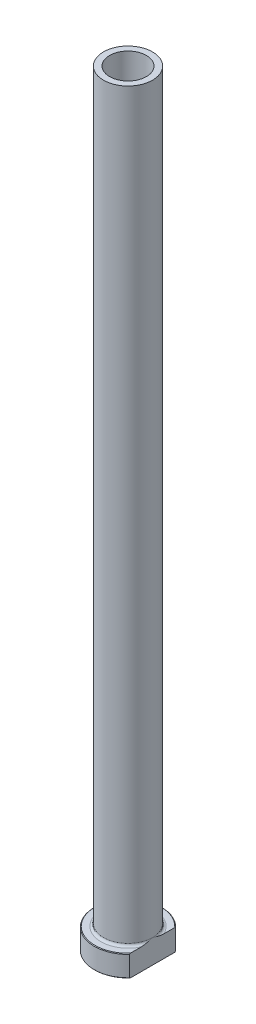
from build123d import *

# Parameters (mm, degrees)
FILLET1_R          = 0.8
CHAMFER1_SIZE      = 0.2
CUT_EXTRUDE1_DEPTH = 251.483532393
CHAMFER2_SIZE      = 0.5


with BuildPart() as part:
    # Sketch1 → Revolve1 (revolve)
    with BuildSketch(Plane.XY, mode=Mode.PRIVATE) as revolve1_sk:
        Polygon((-6, 250), (-8, 250), (-8, 7), (-11, 7), (-11, 0), (-6.25, 0), (-6.25, 183), (-6, 195), align=None)
    revolve(revolve1_sk.sketch.rotate(Axis((0, 92.187680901, 0), (0, -1, 0)), 270), axis=Axis((0, 92.187680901, 0), (0, -1, 0)))

    # Fillet1
    fillet1_edges = [part.edges().sort_by_distance(p)[0] for p in [
        (0, 7, -8),
    ]]
    fillet(fillet1_edges, radius=FILLET1_R)

    # Chamfer1
    chamfer1_edges = [part.edges().sort_by_distance(p)[0] for p in [
        (0, 0, -11),
        (0, 7, -11),
    ]]
    chamfer(chamfer1_edges, length=CHAMFER1_SIZE)

    # Sketch2 → Cut-Extrude1 (cut, through all)
    with BuildSketch(Plane.XZ):
        with BuildLine():
            Line((8, 7.549834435), (8, -7.549834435))
            ThreePointArc((8, -7.549834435), (11, 0), (8, 7.549834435))
        make_face()
    extrude(amount=-CUT_EXTRUDE1_DEPTH, mode=Mode.SUBTRACT)

    # Chamfer2
    chamfer2_edges = [part.edges().sort_by_distance(p)[0] for p in [
        (0, 0, -6.25),
    ]]
    chamfer(chamfer2_edges, length=CHAMFER2_SIZE)


solid = part.part
